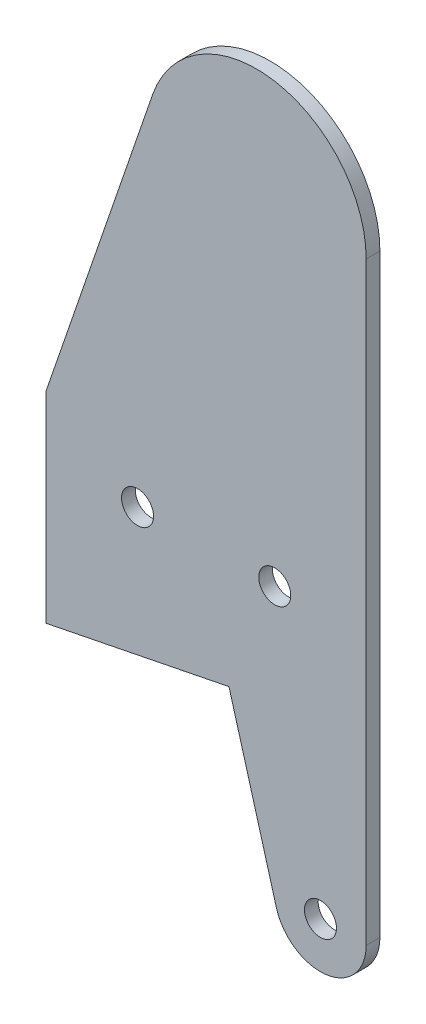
from build123d import *

# Parameters (mm, degrees)
SKETCH1_R      = 1.75
EXTRUDE1_DEPTH = 1.5


with BuildPart() as part:
    # Sketch1 → Extrude1 (new body)
    with BuildSketch(Plane.XY):
        with BuildLine():
            Line((5, 0), (5, 65))
            ThreePointArc((5, 65), (-5.022749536, 76.835982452), (-18.348413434, 68.900450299))
            Line((-18.348413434, 68.900450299), (-30, 35))
            Line((-30, 35), (-30, 13))
            Line((-30, 13), (-10, 17))
            Line((-10, 17), (-4.811559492, -1.359740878))
            ThreePointArc((-4.811559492, -1.359740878), (0.686368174, -4.952665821), (5, 0))
        make_face()
        Circle(SKETCH1_R, mode=Mode.SUBTRACT)
        with Locations((-5, 29)):
            Circle(SKETCH1_R, mode=Mode.SUBTRACT)
        with Locations((-20, 29)):
            Circle(SKETCH1_R, mode=Mode.SUBTRACT)
    extrude(amount=EXTRUDE1_DEPTH)


solid = part.part
